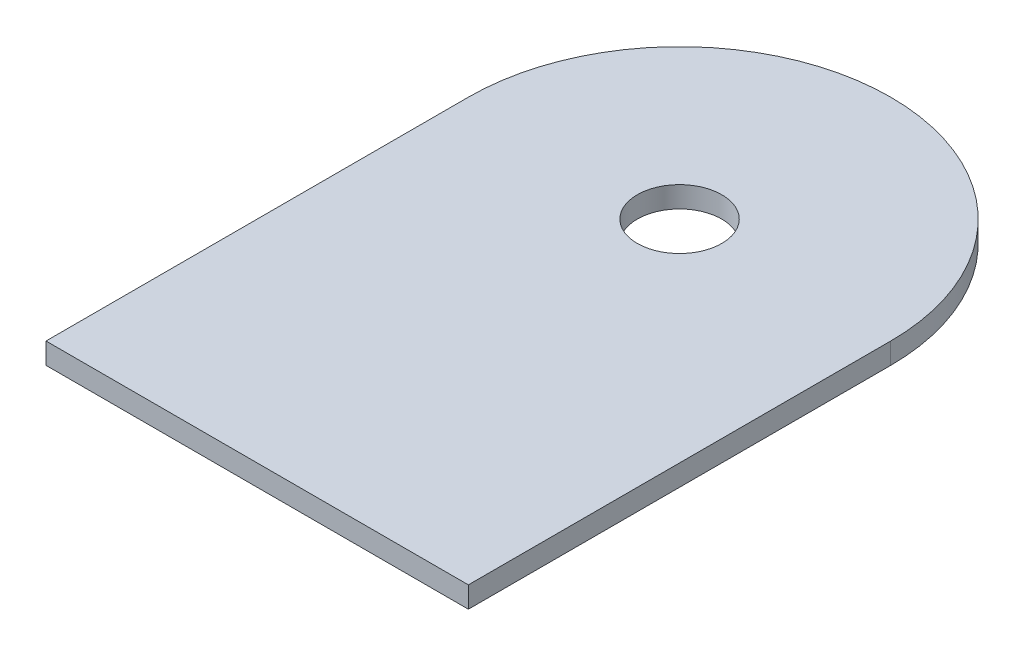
ISO-10303-21;
HEADER;
FILE_DESCRIPTION(('STEP AP214'),'2;1');
FILE_NAME('part.step','',(''),(''),'','','');
FILE_SCHEMA(('AUTOMOTIVE_DESIGN { 1 0 10303 214 1 1 1 1 }'));
ENDSEC;
DATA;
#1=APPLICATION_CONTEXT('core data for automotive mechanical design processes');
#2=APPLICATION_PROTOCOL_DEFINITION('international standard','automotive_design',2000,#1);
#3=PRODUCT_CONTEXT('',#1,'mechanical');
#4=PRODUCT('Part','Part','',(#3));
#5=PRODUCT_RELATED_PRODUCT_CATEGORY('part','',(#4));
#6=PRODUCT_DEFINITION_FORMATION('','',#4);
#7=PRODUCT_DEFINITION_CONTEXT('part definition',#1,'design');
#8=PRODUCT_DEFINITION('design','',#6,#7);
#9=PRODUCT_DEFINITION_SHAPE('','',#8);
#10=(LENGTH_UNIT() NAMED_UNIT(*) SI_UNIT(.MILLI.,.METRE.));
#11=(NAMED_UNIT(*) PLANE_ANGLE_UNIT() SI_UNIT($,.RADIAN.));
#12=(NAMED_UNIT(*) SI_UNIT($,.STERADIAN.) SOLID_ANGLE_UNIT());
#13=UNCERTAINTY_MEASURE_WITH_UNIT(LENGTH_MEASURE(1.E-05),#10,'distance_accuracy_value','');
#14=(GEOMETRIC_REPRESENTATION_CONTEXT(3) GLOBAL_UNCERTAINTY_ASSIGNED_CONTEXT((#13)) GLOBAL_UNIT_ASSIGNED_CONTEXT((#10,
#11,#12)) REPRESENTATION_CONTEXT('',''));
#15=CARTESIAN_POINT('',(0.,0.,0.));
#16=DIRECTION('',(0.,0.,1.));
#17=DIRECTION('',(1.,0.,0.));
#18=AXIS2_PLACEMENT_3D('',#15,#16,#17);
#19=CARTESIAN_POINT('',(0.,2.,0.));
#20=DIRECTION('',(0.,1.,0.));
#21=DIRECTION('',(0.,0.,1.));
#22=AXIS2_PLACEMENT_3D('',#19,#20,#21);
#23=PLANE('',#22);
#24=CARTESIAN_POINT('',(0.,2.,0.));
#25=DIRECTION('',(0.,1.,0.));
#26=DIRECTION('',(0.,0.,1.));
#27=AXIS2_PLACEMENT_3D('',#24,#25,#26);
#28=CIRCLE('',#27,20.);
#29=CARTESIAN_POINT('',(20.,2.,0.));
#30=VERTEX_POINT('',#29);
#31=CARTESIAN_POINT('',(-20.,2.,0.));
#32=VERTEX_POINT('',#31);
#33=EDGE_CURVE('E98',#30,#32,#28,.T.);
#34=ORIENTED_EDGE('',*,*,#33,.T.);
#35=DIRECTION('',(0.,0.,1.));
#36=VECTOR('',#35,1.);
#37=CARTESIAN_POINT('',(-20.,2.,0.));
#38=LINE('',#37,#36);
#39=CARTESIAN_POINT('',(-20.,2.,40.));
#40=VERTEX_POINT('',#39);
#41=EDGE_CURVE('E93',#32,#40,#38,.T.);
#42=ORIENTED_EDGE('',*,*,#41,.T.);
#43=DIRECTION('',(1.,0.,0.));
#44=VECTOR('',#43,1.);
#45=CARTESIAN_POINT('',(20.,2.,40.));
#46=LINE('',#45,#44);
#47=CARTESIAN_POINT('',(20.,2.,40.));
#48=VERTEX_POINT('',#47);
#49=EDGE_CURVE('E96',#40,#48,#46,.T.);
#50=ORIENTED_EDGE('',*,*,#49,.T.);
#51=DIRECTION('',(0.,0.,-1.));
#52=VECTOR('',#51,1.);
#53=CARTESIAN_POINT('',(20.,2.,0.));
#54=LINE('',#53,#52);
#55=EDGE_CURVE('E63',#48,#30,#54,.T.);
#56=ORIENTED_EDGE('',*,*,#55,.T.);
#57=EDGE_LOOP('',(#34,#42,#50,#56));
#58=FACE_BOUND('',#57,.T.);
#59=CARTESIAN_POINT('',(0.,2.,0.));
#60=DIRECTION('',(0.,1.,0.));
#61=DIRECTION('',(0.,0.,1.));
#62=AXIS2_PLACEMENT_3D('',#59,#60,#61);
#63=CIRCLE('',#62,4.);
#64=CARTESIAN_POINT('',(0.,2.,4.));
#65=VERTEX_POINT('',#64);
#66=EDGE_CURVE('E118',#65,#65,#63,.T.);
#67=ORIENTED_EDGE('',*,*,#66,.F.);
#68=EDGE_LOOP('',(#67));
#69=FACE_BOUND('',#68,.T.);
#70=ADVANCED_FACE('F45',(#58,#69),#23,.T.);
#71=CARTESIAN_POINT('',(0.,0.,0.));
#72=DIRECTION('',(0.,1.,0.));
#73=DIRECTION('',(0.,0.,1.));
#74=AXIS2_PLACEMENT_3D('',#71,#72,#73);
#75=PLANE('',#74);
#76=CARTESIAN_POINT('',(0.,0.,0.));
#77=DIRECTION('',(0.,1.,0.));
#78=DIRECTION('',(0.,0.,1.));
#79=AXIS2_PLACEMENT_3D('',#76,#77,#78);
#80=CIRCLE('',#79,20.);
#81=CARTESIAN_POINT('',(20.,0.,0.));
#82=VERTEX_POINT('',#81);
#83=CARTESIAN_POINT('',(-20.,0.,0.));
#84=VERTEX_POINT('',#83);
#85=EDGE_CURVE('E114',#82,#84,#80,.T.);
#86=ORIENTED_EDGE('',*,*,#85,.F.);
#87=DIRECTION('',(0.,0.,-1.));
#88=VECTOR('',#87,1.);
#89=CARTESIAN_POINT('',(20.,0.,0.));
#90=LINE('',#89,#88);
#91=CARTESIAN_POINT('',(20.,0.,40.));
#92=VERTEX_POINT('',#91);
#93=EDGE_CURVE('E86',#92,#82,#90,.T.);
#94=ORIENTED_EDGE('',*,*,#93,.F.);
#95=DIRECTION('',(1.,0.,0.));
#96=VECTOR('',#95,1.);
#97=CARTESIAN_POINT('',(20.,0.,40.));
#98=LINE('',#97,#96);
#99=CARTESIAN_POINT('',(-20.,0.,40.));
#100=VERTEX_POINT('',#99);
#101=EDGE_CURVE('E80',#100,#92,#98,.T.);
#102=ORIENTED_EDGE('',*,*,#101,.F.);
#103=DIRECTION('',(0.,0.,1.));
#104=VECTOR('',#103,1.);
#105=CARTESIAN_POINT('',(-20.,0.,0.));
#106=LINE('',#105,#104);
#107=EDGE_CURVE('E103',#84,#100,#106,.T.);
#108=ORIENTED_EDGE('',*,*,#107,.F.);
#109=EDGE_LOOP('',(#86,#94,#102,#108));
#110=FACE_BOUND('',#109,.T.);
#111=CARTESIAN_POINT('',(0.,0.,0.));
#112=DIRECTION('',(0.,1.,0.));
#113=DIRECTION('',(0.,0.,1.));
#114=AXIS2_PLACEMENT_3D('',#111,#112,#113);
#115=CIRCLE('',#114,4.);
#116=CARTESIAN_POINT('',(0.,0.,4.));
#117=VERTEX_POINT('',#116);
#118=EDGE_CURVE('E136',#117,#117,#115,.T.);
#119=ORIENTED_EDGE('',*,*,#118,.T.);
#120=EDGE_LOOP('',(#119));
#121=FACE_BOUND('',#120,.T.);
#122=ADVANCED_FACE('F131',(#110,#121),#75,.F.);
#123=CARTESIAN_POINT('',(0.,2.,0.));
#124=DIRECTION('',(0.,-1.,0.));
#125=DIRECTION('',(0.,0.,-1.));
#126=AXIS2_PLACEMENT_3D('',#123,#124,#125);
#127=CYLINDRICAL_SURFACE('',#126,20.);
#128=ORIENTED_EDGE('',*,*,#85,.T.);
#129=DIRECTION('',(0.,-1.,0.));
#130=VECTOR('',#129,1.);
#131=CARTESIAN_POINT('',(-20.,2.,0.));
#132=LINE('',#131,#130);
#133=EDGE_CURVE('E11',#32,#84,#132,.T.);
#134=ORIENTED_EDGE('',*,*,#133,.F.);
#135=ORIENTED_EDGE('',*,*,#33,.F.);
#136=DIRECTION('',(0.,-1.,0.));
#137=VECTOR('',#136,1.);
#138=CARTESIAN_POINT('',(20.,2.,0.));
#139=LINE('',#138,#137);
#140=EDGE_CURVE('E110',#30,#82,#139,.T.);
#141=ORIENTED_EDGE('',*,*,#140,.T.);
#142=EDGE_LOOP('',(#128,#134,#135,#141));
#143=FACE_BOUND('',#142,.T.);
#144=ADVANCED_FACE('F47',(#143),#127,.T.);
#145=CARTESIAN_POINT('',(-20.,2.,0.));
#146=DIRECTION('',(1.,0.,0.));
#147=DIRECTION('',(0.,0.,-1.));
#148=AXIS2_PLACEMENT_3D('',#145,#146,#147);
#149=PLANE('',#148);
#150=ORIENTED_EDGE('',*,*,#107,.T.);
#151=DIRECTION('',(0.,-1.,0.));
#152=VECTOR('',#151,1.);
#153=CARTESIAN_POINT('',(-20.,2.,40.));
#154=LINE('',#153,#152);
#155=EDGE_CURVE('E55',#40,#100,#154,.T.);
#156=ORIENTED_EDGE('',*,*,#155,.F.);
#157=ORIENTED_EDGE('',*,*,#41,.F.);
#158=ORIENTED_EDGE('',*,*,#133,.T.);
#159=EDGE_LOOP('',(#150,#156,#157,#158));
#160=FACE_BOUND('',#159,.T.);
#161=ADVANCED_FACE('F102',(#160),#149,.F.);
#162=CARTESIAN_POINT('',(20.,2.,40.));
#163=DIRECTION('',(0.,0.,-1.));
#164=DIRECTION('',(-1.,0.,0.));
#165=AXIS2_PLACEMENT_3D('',#162,#163,#164);
#166=PLANE('',#165);
#167=ORIENTED_EDGE('',*,*,#101,.T.);
#168=DIRECTION('',(0.,-1.,0.));
#169=VECTOR('',#168,1.);
#170=CARTESIAN_POINT('',(20.,2.,40.));
#171=LINE('',#170,#169);
#172=EDGE_CURVE('E105',#48,#92,#171,.T.);
#173=ORIENTED_EDGE('',*,*,#172,.F.);
#174=ORIENTED_EDGE('',*,*,#49,.F.);
#175=ORIENTED_EDGE('',*,*,#155,.T.);
#176=EDGE_LOOP('',(#167,#173,#174,#175));
#177=FACE_BOUND('',#176,.T.);
#178=ADVANCED_FACE('F106',(#177),#166,.F.);
#179=CARTESIAN_POINT('',(20.,2.,0.));
#180=DIRECTION('',(-1.,0.,0.));
#181=DIRECTION('',(0.,0.,1.));
#182=AXIS2_PLACEMENT_3D('',#179,#180,#181);
#183=PLANE('',#182);
#184=ORIENTED_EDGE('',*,*,#93,.T.);
#185=ORIENTED_EDGE('',*,*,#140,.F.);
#186=ORIENTED_EDGE('',*,*,#55,.F.);
#187=ORIENTED_EDGE('',*,*,#172,.T.);
#188=EDGE_LOOP('',(#184,#185,#186,#187));
#189=FACE_BOUND('',#188,.T.);
#190=ADVANCED_FACE('F128',(#189),#183,.F.);
#191=CARTESIAN_POINT('',(0.,2.,0.));
#192=DIRECTION('',(0.,-1.,0.));
#193=DIRECTION('',(0.,0.,-1.));
#194=AXIS2_PLACEMENT_3D('',#191,#192,#193);
#195=CYLINDRICAL_SURFACE('',#194,4.);
#196=ORIENTED_EDGE('',*,*,#66,.T.);
#197=EDGE_LOOP('',(#196));
#198=FACE_BOUND('',#197,.T.);
#199=ORIENTED_EDGE('',*,*,#118,.F.);
#200=EDGE_LOOP('',(#199));
#201=FACE_BOUND('',#200,.T.);
#202=ADVANCED_FACE('F144',(#198,#201),#195,.F.);
#203=CLOSED_SHELL('',(#70,#122,#144,#161,#178,#190,#202));
#204=MANIFOLD_SOLID_BREP('B2',#203);
#205=ADVANCED_BREP_SHAPE_REPRESENTATION('',(#18,#204),#14);
#206=SHAPE_DEFINITION_REPRESENTATION(#9,#205);
ENDSEC;
END-ISO-10303-21;
